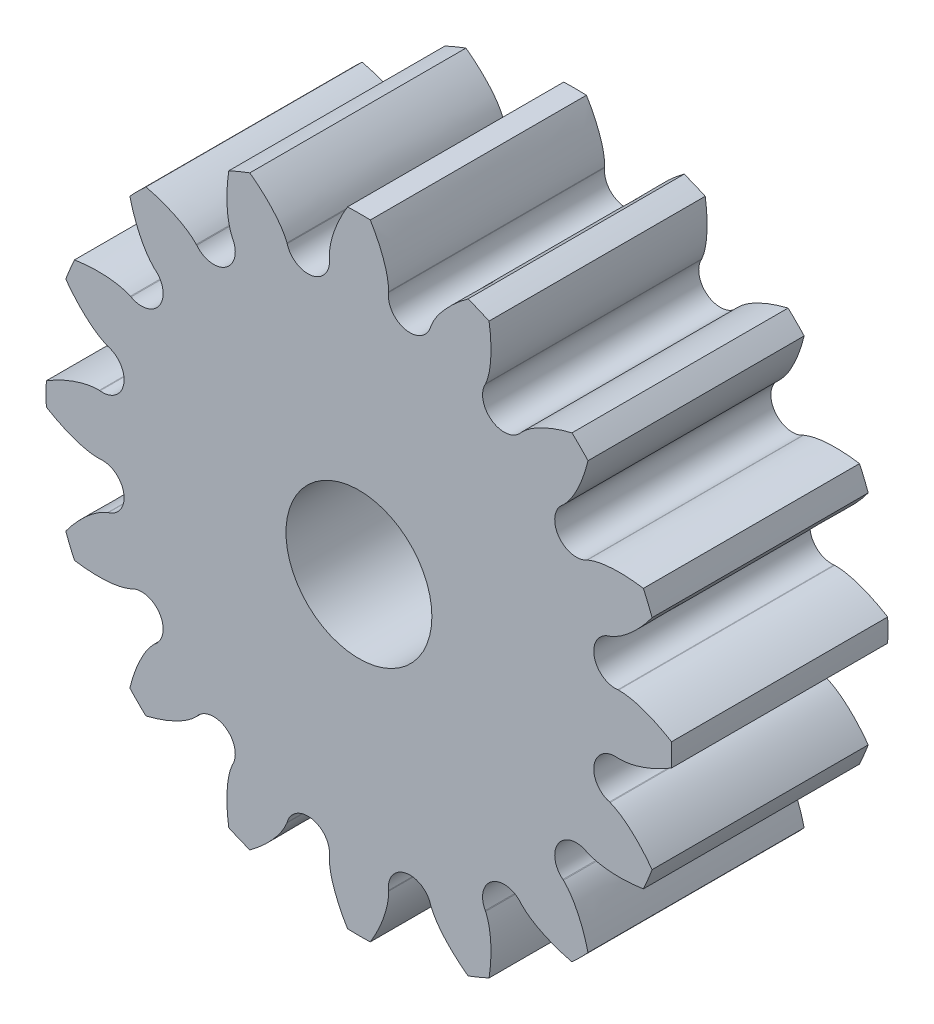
from build123d import *

# Parameters (mm, degrees)
SKETCH3_R                      = 3.3401
SKETCH3_R_2                    = 1.016
BASE_DEPTH                     = 3.0099
HALF_TOOTH_DEPTH               = 3.0099
PATTERN_OF_TOOTH_COUNT         = 16
PATTERN_OF_TOOTH_COPY_1_DEPTH  = 3.0099
PATTERN_OF_TOOTH_COPY_2_DEPTH  = 3.0099
PATTERN_OF_TOOTH_COPY_3_DEPTH  = 3.0099
PATTERN_OF_TOOTH_COPY_4_DEPTH  = 3.0099
PATTERN_OF_TOOTH_COPY_5_DEPTH  = 3.0099
PATTERN_OF_TOOTH_COPY_6_DEPTH  = 3.0099
PATTERN_OF_TOOTH_COPY_7_DEPTH  = 3.0099
PATTERN_OF_TOOTH_COPY_8_DEPTH  = 3.0099
PATTERN_OF_TOOTH_COPY_9_DEPTH  = 3.0099
PATTERN_OF_TOOTH_COPY_10_DEPTH = 3.0099
PATTERN_OF_TOOTH_COPY_11_DEPTH = 3.0099
PATTERN_OF_TOOTH_COPY_12_DEPTH = 3.0099
PATTERN_OF_TOOTH_COPY_13_DEPTH = 3.0099
PATTERN_OF_TOOTH_COPY_14_DEPTH = 3.0099
PATTERN_OF_TOOTH_COPY_15_DEPTH = 3.0099


with BuildPart() as part:
    # Sketch3 → Base (new body)
    with BuildSketch(Plane.XY):
        Circle(SKETCH3_R)
        Circle(SKETCH3_R_2, mode=Mode.SUBTRACT)
    extrude(amount=BASE_DEPTH)

    # Sketch2 → Half tooth (add)
    with BuildSketch(Plane.XY):
        with BuildLine():
            Line((0, 4.3561), (0, 3.3401))
            ThreePointArc((0, 3.3401), (0.32738705, 3.324016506), (0.651621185, 3.275920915))
            ThreePointArc((0.651621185, 3.275920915), (0.467325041, 3.393625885), (0.411449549, 3.605043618))
            Line((0.411449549, 3.605043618), (0.412597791, 3.615104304))
            add(Edge.make_bspline(
                [(0.158354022, 4.353220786), (0.239658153, 4.219695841), (0.355568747, 3.981504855), (0.41384102, 3.72189163), (0.412597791, 3.615104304)],
                knots=[0, 0, 0, 0, 0.595051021, 1, 1, 1, 1], degree=3))
            ThreePointArc((0.158354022, 4.353220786), (0.079190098, 4.355380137), (0, 4.3561))
        make_face()
    half_tooth = extrude(amount=HALF_TOOTH_DEPTH)

    # Mirror of half tooth: Half tooth across plane
    add(half_tooth.mirror(Plane.ZY))

    # Pattern of tooth: Half tooth ×16 about axis
    pattern_of_tooth_axis = Axis((0, 0, 0), (0, 0, -1))
    for i in range(1, PATTERN_OF_TOOTH_COUNT):
        add(half_tooth.rotate(pattern_of_tooth_axis, i * 360 / PATTERN_OF_TOOTH_COUNT))

    # Pattern of tooth copy 1 sketch → Pattern of tooth copy 1 (add)
    with BuildSketch(Plane(origin=(0, 0, 0), x_dir=(-0.9238795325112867, 0.3826834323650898, 0), z_dir=(0, 0, 1))):
        with BuildLine():
            Line((0, -4.3561), (0, -3.3401))
            ThreePointArc((0, -3.3401), (0.32738705, -3.324016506), (0.651621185, -3.275920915))
            ThreePointArc((0.651621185, -3.275920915), (0.467325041, -3.393625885), (0.411449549, -3.605043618))
            Line((0.411449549, -3.605043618), (0.412597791, -3.615104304))
            add(Edge.make_bspline(
                [(0.158354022, -4.353220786), (0.239658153, -4.219695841), (0.355568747, -3.981504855), (0.41384102, -3.72189163), (0.412597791, -3.615104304)],
                knots=[0, 0, 0, 0, 0.595051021, 1, 1, 1, 1], degree=3))
            ThreePointArc((0.158354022, -4.353220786), (0.079190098, -4.355380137), (0, -4.3561))
        make_face()
    extrude(amount=PATTERN_OF_TOOTH_COPY_1_DEPTH)

    # Pattern of tooth copy 2 sketch → Pattern of tooth copy 2 (add)
    with BuildSketch(Plane(origin=(0, 0, 0), x_dir=(-0.7071067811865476, 0.7071067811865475, 0), z_dir=(0, 0, 1))):
        with BuildLine():
            Line((0, -4.3561), (0, -3.3401))
            ThreePointArc((0, -3.3401), (0.32738705, -3.324016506), (0.651621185, -3.275920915))
            ThreePointArc((0.651621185, -3.275920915), (0.467325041, -3.393625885), (0.411449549, -3.605043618))
            Line((0.411449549, -3.605043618), (0.412597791, -3.615104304))
            add(Edge.make_bspline(
                [(0.158354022, -4.353220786), (0.239658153, -4.219695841), (0.355568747, -3.981504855), (0.41384102, -3.72189163), (0.412597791, -3.615104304)],
                knots=[0, 0, 0, 0, 0.595051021, 1, 1, 1, 1], degree=3))
            ThreePointArc((0.158354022, -4.353220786), (0.079190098, -4.355380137), (0, -4.3561))
        make_face()
    extrude(amount=PATTERN_OF_TOOTH_COPY_2_DEPTH)

    # Pattern of tooth copy 3 sketch → Pattern of tooth copy 3 (add)
    with BuildSketch(Plane(origin=(0, 0, 0), x_dir=(-0.38268343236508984, 0.9238795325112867, 0), z_dir=(0, 0, 1))):
        with BuildLine():
            Line((0, -4.3561), (0, -3.3401))
            ThreePointArc((0, -3.3401), (0.32738705, -3.324016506), (0.651621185, -3.275920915))
            ThreePointArc((0.651621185, -3.275920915), (0.467325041, -3.393625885), (0.411449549, -3.605043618))
            Line((0.411449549, -3.605043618), (0.412597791, -3.615104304))
            add(Edge.make_bspline(
                [(0.158354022, -4.353220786), (0.239658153, -4.219695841), (0.355568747, -3.981504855), (0.41384102, -3.72189163), (0.412597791, -3.615104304)],
                knots=[0, 0, 0, 0, 0.595051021, 1, 1, 1, 1], degree=3))
            ThreePointArc((0.158354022, -4.353220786), (0.079190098, -4.355380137), (0, -4.3561))
        make_face()
    extrude(amount=PATTERN_OF_TOOTH_COPY_3_DEPTH)

    # Pattern of tooth copy 4 sketch → Pattern of tooth copy 4 (add)
    with BuildSketch(Plane(origin=(0, 0, 0), x_dir=(0, 1, 0), z_dir=(0, 0, 1))):
        with BuildLine():
            Line((0, -4.3561), (0, -3.3401))
            ThreePointArc((0, -3.3401), (0.32738705, -3.324016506), (0.651621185, -3.275920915))
            ThreePointArc((0.651621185, -3.275920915), (0.467325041, -3.393625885), (0.411449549, -3.605043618))
            Line((0.411449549, -3.605043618), (0.412597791, -3.615104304))
            add(Edge.make_bspline(
                [(0.158354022, -4.353220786), (0.239658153, -4.219695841), (0.355568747, -3.981504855), (0.41384102, -3.72189163), (0.412597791, -3.615104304)],
                knots=[0, 0, 0, 0, 0.595051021, 1, 1, 1, 1], degree=3))
            ThreePointArc((0.158354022, -4.353220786), (0.079190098, -4.355380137), (0, -4.3561))
        make_face()
    extrude(amount=PATTERN_OF_TOOTH_COPY_4_DEPTH)

    # Pattern of tooth copy 5 sketch → Pattern of tooth copy 5 (add)
    with BuildSketch(Plane(origin=(0, 0, 0), x_dir=(0.3826834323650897, 0.9238795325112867, 0), z_dir=(0, 0, 1))):
        with BuildLine():
            Line((0, -4.3561), (0, -3.3401))
            ThreePointArc((0, -3.3401), (0.32738705, -3.324016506), (0.651621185, -3.275920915))
            ThreePointArc((0.651621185, -3.275920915), (0.467325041, -3.393625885), (0.411449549, -3.605043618))
            Line((0.411449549, -3.605043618), (0.412597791, -3.615104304))
            add(Edge.make_bspline(
                [(0.158354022, -4.353220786), (0.239658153, -4.219695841), (0.355568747, -3.981504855), (0.41384102, -3.72189163), (0.412597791, -3.615104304)],
                knots=[0, 0, 0, 0, 0.595051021, 1, 1, 1, 1], degree=3))
            ThreePointArc((0.158354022, -4.353220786), (0.079190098, -4.355380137), (0, -4.3561))
        make_face()
    extrude(amount=PATTERN_OF_TOOTH_COPY_5_DEPTH)

    # Pattern of tooth copy 6 sketch → Pattern of tooth copy 6 (add)
    with BuildSketch(Plane(origin=(0, 0, 0), x_dir=(0.7071067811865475, 0.7071067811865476, 0), z_dir=(0, 0, 1))):
        with BuildLine():
            Line((0, -4.3561), (0, -3.3401))
            ThreePointArc((0, -3.3401), (0.32738705, -3.324016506), (0.651621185, -3.275920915))
            ThreePointArc((0.651621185, -3.275920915), (0.467325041, -3.393625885), (0.411449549, -3.605043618))
            Line((0.411449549, -3.605043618), (0.412597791, -3.615104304))
            add(Edge.make_bspline(
                [(0.158354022, -4.353220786), (0.239658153, -4.219695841), (0.355568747, -3.981504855), (0.41384102, -3.72189163), (0.412597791, -3.615104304)],
                knots=[0, 0, 0, 0, 0.595051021, 1, 1, 1, 1], degree=3))
            ThreePointArc((0.158354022, -4.353220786), (0.079190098, -4.355380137), (0, -4.3561))
        make_face()
    extrude(amount=PATTERN_OF_TOOTH_COPY_6_DEPTH)

    # Pattern of tooth copy 7 sketch → Pattern of tooth copy 7 (add)
    with BuildSketch(Plane(origin=(0, 0, 0), x_dir=(0.9238795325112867, 0.3826834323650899, 0), z_dir=(0, 0, 1))):
        with BuildLine():
            Line((0, -4.3561), (0, -3.3401))
            ThreePointArc((0, -3.3401), (0.32738705, -3.324016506), (0.651621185, -3.275920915))
            ThreePointArc((0.651621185, -3.275920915), (0.467325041, -3.393625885), (0.411449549, -3.605043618))
            Line((0.411449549, -3.605043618), (0.412597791, -3.615104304))
            add(Edge.make_bspline(
                [(0.158354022, -4.353220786), (0.239658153, -4.219695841), (0.355568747, -3.981504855), (0.41384102, -3.72189163), (0.412597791, -3.615104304)],
                knots=[0, 0, 0, 0, 0.595051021, 1, 1, 1, 1], degree=3))
            ThreePointArc((0.158354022, -4.353220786), (0.079190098, -4.355380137), (0, -4.3561))
        make_face()
    extrude(amount=PATTERN_OF_TOOTH_COPY_7_DEPTH)

    # Pattern of tooth copy 8 sketch → Pattern of tooth copy 8 (add)
    with BuildSketch(Plane.XY):
        with BuildLine():
            Line((0, -4.3561), (0, -3.3401))
            ThreePointArc((0, -3.3401), (0.32738705, -3.324016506), (0.651621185, -3.275920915))
            ThreePointArc((0.651621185, -3.275920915), (0.467325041, -3.393625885), (0.411449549, -3.605043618))
            Line((0.411449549, -3.605043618), (0.412597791, -3.615104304))
            add(Edge.make_bspline(
                [(0.158354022, -4.353220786), (0.239658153, -4.219695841), (0.355568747, -3.981504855), (0.41384102, -3.72189163), (0.412597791, -3.615104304)],
                knots=[0, 0, 0, 0, 0.595051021, 1, 1, 1, 1], degree=3))
            ThreePointArc((0.158354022, -4.353220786), (0.079190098, -4.355380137), (0, -4.3561))
        make_face()
    extrude(amount=PATTERN_OF_TOOTH_COPY_8_DEPTH)

    # Pattern of tooth copy 9 sketch → Pattern of tooth copy 9 (add)
    with BuildSketch(Plane(origin=(0, 0, 0), x_dir=(0.9238795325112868, -0.38268343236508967, 0), z_dir=(0, 0, 1))):
        with BuildLine():
            Line((0, -4.3561), (0, -3.3401))
            ThreePointArc((0, -3.3401), (0.32738705, -3.324016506), (0.651621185, -3.275920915))
            ThreePointArc((0.651621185, -3.275920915), (0.467325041, -3.393625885), (0.411449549, -3.605043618))
            Line((0.411449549, -3.605043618), (0.412597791, -3.615104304))
            add(Edge.make_bspline(
                [(0.158354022, -4.353220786), (0.239658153, -4.219695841), (0.355568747, -3.981504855), (0.41384102, -3.72189163), (0.412597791, -3.615104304)],
                knots=[0, 0, 0, 0, 0.595051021, 1, 1, 1, 1], degree=3))
            ThreePointArc((0.158354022, -4.353220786), (0.079190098, -4.355380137), (0, -4.3561))
        make_face()
    extrude(amount=PATTERN_OF_TOOTH_COPY_9_DEPTH)

    # Pattern of tooth copy 10 sketch → Pattern of tooth copy 10 (add)
    with BuildSketch(Plane(origin=(0, 0, 0), x_dir=(0.7071067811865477, -0.7071067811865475, 0), z_dir=(0, 0, 1))):
        with BuildLine():
            Line((0, -4.3561), (0, -3.3401))
            ThreePointArc((0, -3.3401), (0.32738705, -3.324016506), (0.651621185, -3.275920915))
            ThreePointArc((0.651621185, -3.275920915), (0.467325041, -3.393625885), (0.411449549, -3.605043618))
            Line((0.411449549, -3.605043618), (0.412597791, -3.615104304))
            add(Edge.make_bspline(
                [(0.158354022, -4.353220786), (0.239658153, -4.219695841), (0.355568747, -3.981504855), (0.41384102, -3.72189163), (0.412597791, -3.615104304)],
                knots=[0, 0, 0, 0, 0.595051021, 1, 1, 1, 1], degree=3))
            ThreePointArc((0.158354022, -4.353220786), (0.079190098, -4.355380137), (0, -4.3561))
        make_face()
    extrude(amount=PATTERN_OF_TOOTH_COPY_10_DEPTH)

    # Pattern of tooth copy 11 sketch → Pattern of tooth copy 11 (add)
    with BuildSketch(Plane(origin=(0, 0, 0), x_dir=(0.3826834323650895, -0.9238795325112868, 0), z_dir=(0, 0, 1))):
        with BuildLine():
            Line((0, -4.3561), (0, -3.3401))
            ThreePointArc((0, -3.3401), (0.32738705, -3.324016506), (0.651621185, -3.275920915))
            ThreePointArc((0.651621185, -3.275920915), (0.467325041, -3.393625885), (0.411449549, -3.605043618))
            Line((0.411449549, -3.605043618), (0.412597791, -3.615104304))
            add(Edge.make_bspline(
                [(0.158354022, -4.353220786), (0.239658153, -4.219695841), (0.355568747, -3.981504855), (0.41384102, -3.72189163), (0.412597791, -3.615104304)],
                knots=[0, 0, 0, 0, 0.595051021, 1, 1, 1, 1], degree=3))
            ThreePointArc((0.158354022, -4.353220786), (0.079190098, -4.355380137), (0, -4.3561))
        make_face()
    extrude(amount=PATTERN_OF_TOOTH_COPY_11_DEPTH)

    # Pattern of tooth copy 12 sketch → Pattern of tooth copy 12 (add)
    with BuildSketch(Plane(origin=(0, 0, 0), x_dir=(0, -1, 0), z_dir=(0, 0, 1))):
        with BuildLine():
            Line((0, -4.3561), (0, -3.3401))
            ThreePointArc((0, -3.3401), (0.32738705, -3.324016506), (0.651621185, -3.275920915))
            ThreePointArc((0.651621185, -3.275920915), (0.467325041, -3.393625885), (0.411449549, -3.605043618))
            Line((0.411449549, -3.605043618), (0.412597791, -3.615104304))
            add(Edge.make_bspline(
                [(0.158354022, -4.353220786), (0.239658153, -4.219695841), (0.355568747, -3.981504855), (0.41384102, -3.72189163), (0.412597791, -3.615104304)],
                knots=[0, 0, 0, 0, 0.595051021, 1, 1, 1, 1], degree=3))
            ThreePointArc((0.158354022, -4.353220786), (0.079190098, -4.355380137), (0, -4.3561))
        make_face()
    extrude(amount=PATTERN_OF_TOOTH_COPY_12_DEPTH)

    # Pattern of tooth copy 13 sketch → Pattern of tooth copy 13 (add)
    with BuildSketch(Plane(origin=(0, 0, 0), x_dir=(-0.38268343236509, -0.9238795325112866, 0), z_dir=(0, 0, 1))):
        with BuildLine():
            Line((0, -4.3561), (0, -3.3401))
            ThreePointArc((0, -3.3401), (0.32738705, -3.324016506), (0.651621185, -3.275920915))
            ThreePointArc((0.651621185, -3.275920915), (0.467325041, -3.393625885), (0.411449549, -3.605043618))
            Line((0.411449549, -3.605043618), (0.412597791, -3.615104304))
            add(Edge.make_bspline(
                [(0.158354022, -4.353220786), (0.239658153, -4.219695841), (0.355568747, -3.981504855), (0.41384102, -3.72189163), (0.412597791, -3.615104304)],
                knots=[0, 0, 0, 0, 0.595051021, 1, 1, 1, 1], degree=3))
            ThreePointArc((0.158354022, -4.353220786), (0.079190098, -4.355380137), (0, -4.3561))
        make_face()
    extrude(amount=PATTERN_OF_TOOTH_COPY_13_DEPTH)

    # Pattern of tooth copy 14 sketch → Pattern of tooth copy 14 (add)
    with BuildSketch(Plane(origin=(0, 0, 0), x_dir=(-0.7071067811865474, -0.7071067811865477, 0), z_dir=(0, 0, 1))):
        with BuildLine():
            Line((0, -4.3561), (0, -3.3401))
            ThreePointArc((0, -3.3401), (0.32738705, -3.324016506), (0.651621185, -3.275920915))
            ThreePointArc((0.651621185, -3.275920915), (0.467325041, -3.393625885), (0.411449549, -3.605043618))
            Line((0.411449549, -3.605043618), (0.412597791, -3.615104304))
            add(Edge.make_bspline(
                [(0.158354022, -4.353220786), (0.239658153, -4.219695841), (0.355568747, -3.981504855), (0.41384102, -3.72189163), (0.412597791, -3.615104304)],
                knots=[0, 0, 0, 0, 0.595051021, 1, 1, 1, 1], degree=3))
            ThreePointArc((0.158354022, -4.353220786), (0.079190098, -4.355380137), (0, -4.3561))
        make_face()
    extrude(amount=PATTERN_OF_TOOTH_COPY_14_DEPTH)

    # Pattern of tooth copy 15 sketch → Pattern of tooth copy 15 (add)
    with BuildSketch(Plane(origin=(0, 0, 0), x_dir=(-0.9238795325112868, -0.38268343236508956, 0), z_dir=(0, 0, 1))):
        with BuildLine():
            Line((0, -4.3561), (0, -3.3401))
            ThreePointArc((0, -3.3401), (0.32738705, -3.324016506), (0.651621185, -3.275920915))
            ThreePointArc((0.651621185, -3.275920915), (0.467325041, -3.393625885), (0.411449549, -3.605043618))
            Line((0.411449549, -3.605043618), (0.412597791, -3.615104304))
            add(Edge.make_bspline(
                [(0.158354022, -4.353220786), (0.239658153, -4.219695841), (0.355568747, -3.981504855), (0.41384102, -3.72189163), (0.412597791, -3.615104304)],
                knots=[0, 0, 0, 0, 0.595051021, 1, 1, 1, 1], degree=3))
            ThreePointArc((0.158354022, -4.353220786), (0.079190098, -4.355380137), (0, -4.3561))
        make_face()
    extrude(amount=PATTERN_OF_TOOTH_COPY_15_DEPTH)


solid = part.part
